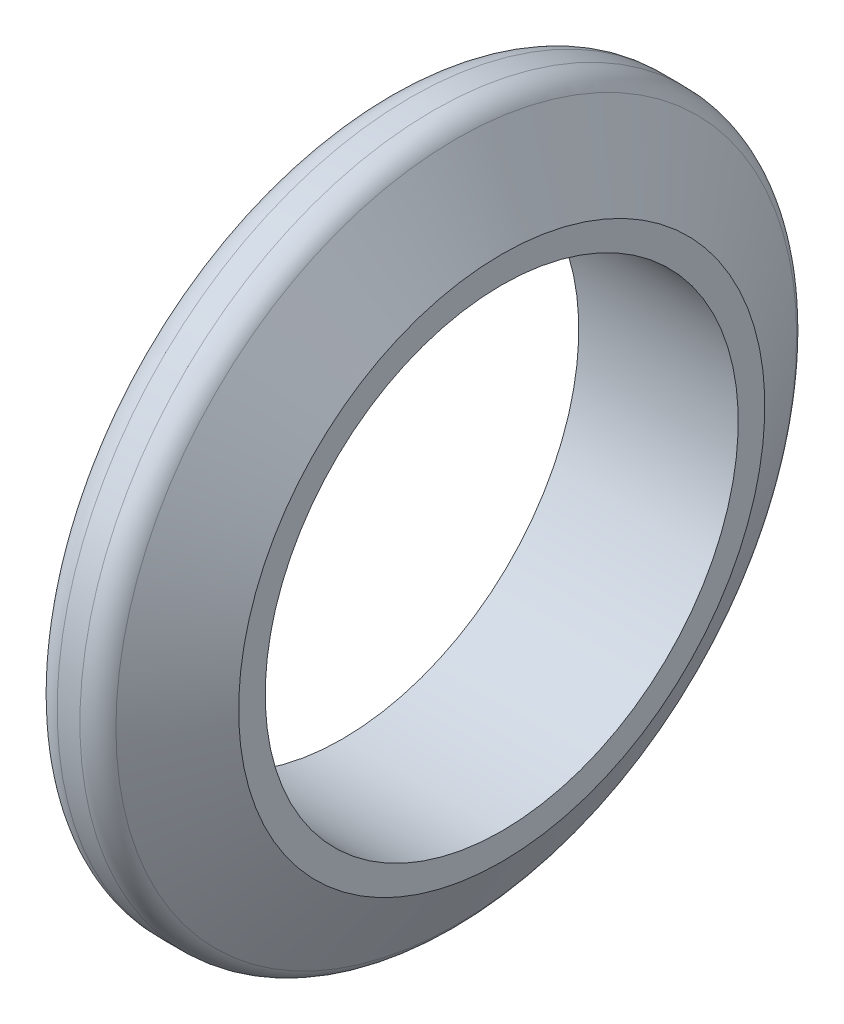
ISO-10303-21;
HEADER;
FILE_DESCRIPTION(('STEP AP214'),'2;1');
FILE_NAME('part.step','',(''),(''),'','','');
FILE_SCHEMA(('AUTOMOTIVE_DESIGN { 1 0 10303 214 1 1 1 1 }'));
ENDSEC;
DATA;
#1=APPLICATION_CONTEXT('core data for automotive mechanical design processes');
#2=APPLICATION_PROTOCOL_DEFINITION('international standard','automotive_design',2000,#1);
#3=PRODUCT_CONTEXT('',#1,'mechanical');
#4=PRODUCT('Part','Part','',(#3));
#5=PRODUCT_RELATED_PRODUCT_CATEGORY('part','',(#4));
#6=PRODUCT_DEFINITION_FORMATION('','',#4);
#7=PRODUCT_DEFINITION_CONTEXT('part definition',#1,'design');
#8=PRODUCT_DEFINITION('design','',#6,#7);
#9=PRODUCT_DEFINITION_SHAPE('','',#8);
#10=(LENGTH_UNIT() NAMED_UNIT(*) SI_UNIT(.MILLI.,.METRE.));
#11=(NAMED_UNIT(*) PLANE_ANGLE_UNIT() SI_UNIT($,.RADIAN.));
#12=(NAMED_UNIT(*) SI_UNIT($,.STERADIAN.) SOLID_ANGLE_UNIT());
#13=UNCERTAINTY_MEASURE_WITH_UNIT(LENGTH_MEASURE(1.E-05),#10,'distance_accuracy_value','');
#14=(GEOMETRIC_REPRESENTATION_CONTEXT(3) GLOBAL_UNCERTAINTY_ASSIGNED_CONTEXT((#13)) GLOBAL_UNIT_ASSIGNED_CONTEXT((#10,
#11,#12)) REPRESENTATION_CONTEXT('',''));
#15=CARTESIAN_POINT('',(0.,0.,0.));
#16=DIRECTION('',(0.,0.,1.));
#17=DIRECTION('',(1.,0.,0.));
#18=AXIS2_PLACEMENT_3D('',#15,#16,#17);
#19=CARTESIAN_POINT('',(0.,0.,0.));
#20=DIRECTION('',(-1.,0.,0.));
#21=DIRECTION('',(0.,-1.,0.));
#22=AXIS2_PLACEMENT_3D('',#19,#20,#21);
#23=PLANE('',#22);
#24=CARTESIAN_POINT('',(0.,0.,0.));
#25=DIRECTION('',(1.,0.,0.));
#26=DIRECTION('',(0.,1.,0.));
#27=AXIS2_PLACEMENT_3D('',#24,#25,#26);
#28=CIRCLE('',#27,44.5);
#29=CARTESIAN_POINT('',(0.,44.5,0.));
#30=VERTEX_POINT('',#29);
#31=EDGE_CURVE('E58',#30,#30,#28,.T.);
#32=ORIENTED_EDGE('',*,*,#31,.F.);
#33=EDGE_LOOP('',(#32));
#34=FACE_BOUND('',#33,.T.);
#35=CARTESIAN_POINT('',(0.,0.,0.));
#36=DIRECTION('',(-1.,0.,0.));
#37=DIRECTION('',(0.,-1.,0.));
#38=AXIS2_PLACEMENT_3D('',#35,#36,#37);
#39=CIRCLE('',#38,49.5);
#40=CARTESIAN_POINT('',(0.,-49.5,0.));
#41=VERTEX_POINT('',#40);
#42=EDGE_CURVE('E10',#41,#41,#39,.T.);
#43=ORIENTED_EDGE('',*,*,#42,.F.);
#44=EDGE_LOOP('',(#43));
#45=FACE_BOUND('',#44,.T.);
#46=ADVANCED_FACE('F30',(#34,#45),#23,.F.);
#47=CARTESIAN_POINT('',(0.,0.,0.));
#48=DIRECTION('',(-1.,0.,0.));
#49=DIRECTION('',(0.,-1.,0.));
#50=AXIS2_PLACEMENT_3D('',#47,#48,#49);
#51=CONICAL_SURFACE('',#50,49.5,1.03907225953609);
#52=CARTESIAN_POINT('',(-8.55005919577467,0.,0.));
#53=DIRECTION('',(-1.,0.,0.));
#54=DIRECTION('',(0.,-1.,0.));
#55=AXIS2_PLACEMENT_3D('',#52,#53,#54);
#56=CIRCLE('',#55,64.0351006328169);
#57=CARTESIAN_POINT('',(-8.55005919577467,-64.0351006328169,0.));
#58=VERTEX_POINT('',#57);
#59=EDGE_CURVE('E36',#58,#58,#56,.T.);
#60=ORIENTED_EDGE('',*,*,#59,.F.);
#61=EDGE_LOOP('',(#60));
#62=FACE_BOUND('',#61,.T.);
#63=ORIENTED_EDGE('',*,*,#42,.T.);
#64=EDGE_LOOP('',(#63));
#65=FACE_BOUND('',#64,.T.);
#66=ADVANCED_FACE('F66',(#62,#65),#51,.T.);
#67=CARTESIAN_POINT('',(-12.8597302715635,0.,0.));
#68=DIRECTION('',(-1.,0.,0.));
#69=DIRECTION('',(0.,-1.,0.));
#70=AXIS2_PLACEMENT_3D('',#67,#68,#69);
#71=TOROIDAL_SURFACE('',#70,61.5,5.);
#72=CARTESIAN_POINT('',(-12.8597302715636,0.,0.));
#73=DIRECTION('',(-1.,0.,0.));
#74=DIRECTION('',(0.,-1.,0.));
#75=AXIS2_PLACEMENT_3D('',#72,#73,#74);
#76=CIRCLE('',#75,66.5);
#77=CARTESIAN_POINT('',(-12.8597302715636,-66.5,0.));
#78=VERTEX_POINT('',#77);
#79=EDGE_CURVE('E40',#78,#78,#76,.T.);
#80=ORIENTED_EDGE('',*,*,#79,.F.);
#81=EDGE_LOOP('',(#80));
#82=FACE_BOUND('',#81,.T.);
#83=ORIENTED_EDGE('',*,*,#59,.T.);
#84=EDGE_LOOP('',(#83));
#85=FACE_BOUND('',#84,.T.);
#86=ADVANCED_FACE('F70',(#82,#85),#71,.T.);
#87=CARTESIAN_POINT('',(-62.6155251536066,0.,0.));
#88=DIRECTION('',(-1.,0.,0.));
#89=DIRECTION('',(0.,-1.,0.));
#90=AXIS2_PLACEMENT_3D('',#87,#88,#89);
#91=CYLINDRICAL_SURFACE('',#90,66.5);
#92=CARTESIAN_POINT('',(-17.1402697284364,0.,0.));
#93=DIRECTION('',(-1.,0.,0.));
#94=DIRECTION('',(0.,-1.,0.));
#95=AXIS2_PLACEMENT_3D('',#92,#93,#94);
#96=CIRCLE('',#95,66.5);
#97=CARTESIAN_POINT('',(-17.1402697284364,-66.5,0.));
#98=VERTEX_POINT('',#97);
#99=EDGE_CURVE('E44',#98,#98,#96,.T.);
#100=ORIENTED_EDGE('',*,*,#99,.F.);
#101=EDGE_LOOP('',(#100));
#102=FACE_BOUND('',#101,.T.);
#103=ORIENTED_EDGE('',*,*,#79,.T.);
#104=EDGE_LOOP('',(#103));
#105=FACE_BOUND('',#104,.T.);
#106=ADVANCED_FACE('F75',(#102,#105),#91,.T.);
#107=CARTESIAN_POINT('',(-17.1402697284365,0.,0.));
#108=DIRECTION('',(-1.,0.,0.));
#109=DIRECTION('',(0.,-1.,0.));
#110=AXIS2_PLACEMENT_3D('',#107,#108,#109);
#111=TOROIDAL_SURFACE('',#110,61.5,5.);
#112=CARTESIAN_POINT('',(-21.4499408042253,0.,0.));
#113=DIRECTION('',(-1.,0.,0.));
#114=DIRECTION('',(0.,-1.,0.));
#115=AXIS2_PLACEMENT_3D('',#112,#113,#114);
#116=CIRCLE('',#115,64.0351006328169);
#117=CARTESIAN_POINT('',(-21.4499408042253,-64.0351006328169,0.));
#118=VERTEX_POINT('',#117);
#119=EDGE_CURVE('E49',#118,#118,#116,.T.);
#120=ORIENTED_EDGE('',*,*,#119,.F.);
#121=EDGE_LOOP('',(#120));
#122=FACE_BOUND('',#121,.T.);
#123=ORIENTED_EDGE('',*,*,#99,.T.);
#124=EDGE_LOOP('',(#123));
#125=FACE_BOUND('',#124,.T.);
#126=ADVANCED_FACE('F81',(#122,#125),#111,.T.);
#127=CARTESIAN_POINT('',(-21.4499408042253,0.,0.));
#128=DIRECTION('',(1.,0.,0.));
#129=DIRECTION('',(0.,1.,0.));
#130=AXIS2_PLACEMENT_3D('',#127,#128,#129);
#131=CONICAL_SURFACE('',#130,64.0351006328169,1.03907225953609);
#132=CARTESIAN_POINT('',(-30.,0.,0.));
#133=DIRECTION('',(-1.,0.,0.));
#134=DIRECTION('',(0.,-1.,0.));
#135=AXIS2_PLACEMENT_3D('',#132,#133,#134);
#136=CIRCLE('',#135,49.5);
#137=CARTESIAN_POINT('',(-30.,-49.5,0.));
#138=VERTEX_POINT('',#137);
#139=EDGE_CURVE('E52',#138,#138,#136,.T.);
#140=ORIENTED_EDGE('',*,*,#139,.F.);
#141=EDGE_LOOP('',(#140));
#142=FACE_BOUND('',#141,.T.);
#143=ORIENTED_EDGE('',*,*,#119,.T.);
#144=EDGE_LOOP('',(#143));
#145=FACE_BOUND('',#144,.T.);
#146=ADVANCED_FACE('F85',(#142,#145),#131,.T.);
#147=CARTESIAN_POINT('',(-30.,0.,0.));
#148=DIRECTION('',(1.,0.,0.));
#149=DIRECTION('',(0.,1.,0.));
#150=AXIS2_PLACEMENT_3D('',#147,#148,#149);
#151=PLANE('',#150);
#152=CARTESIAN_POINT('',(-30.,0.,0.));
#153=DIRECTION('',(1.,0.,0.));
#154=DIRECTION('',(0.,1.,0.));
#155=AXIS2_PLACEMENT_3D('',#152,#153,#154);
#156=CIRCLE('',#155,44.5);
#157=CARTESIAN_POINT('',(-30.,44.5,0.));
#158=VERTEX_POINT('',#157);
#159=EDGE_CURVE('E55',#158,#158,#156,.T.);
#160=ORIENTED_EDGE('',*,*,#159,.T.);
#161=EDGE_LOOP('',(#160));
#162=FACE_BOUND('',#161,.T.);
#163=ORIENTED_EDGE('',*,*,#139,.T.);
#164=EDGE_LOOP('',(#163));
#165=FACE_BOUND('',#164,.T.);
#166=ADVANCED_FACE('F89',(#162,#165),#151,.F.);
#167=CARTESIAN_POINT('',(-30.,0.,0.));
#168=DIRECTION('',(1.,0.,0.));
#169=DIRECTION('',(0.,1.,0.));
#170=AXIS2_PLACEMENT_3D('',#167,#168,#169);
#171=CYLINDRICAL_SURFACE('',#170,44.5);
#172=ORIENTED_EDGE('',*,*,#159,.F.);
#173=EDGE_LOOP('',(#172));
#174=FACE_BOUND('',#173,.T.);
#175=ORIENTED_EDGE('',*,*,#31,.T.);
#176=EDGE_LOOP('',(#175));
#177=FACE_BOUND('',#176,.T.);
#178=ADVANCED_FACE('F62',(#174,#177),#171,.F.);
#179=CLOSED_SHELL('',(#46,#66,#86,#106,#126,#146,#166,#178));
#180=MANIFOLD_SOLID_BREP('B2',#179);
#181=ADVANCED_BREP_SHAPE_REPRESENTATION('',(#18,#180),#14);
#182=SHAPE_DEFINITION_REPRESENTATION(#9,#181);
ENDSEC;
END-ISO-10303-21;
